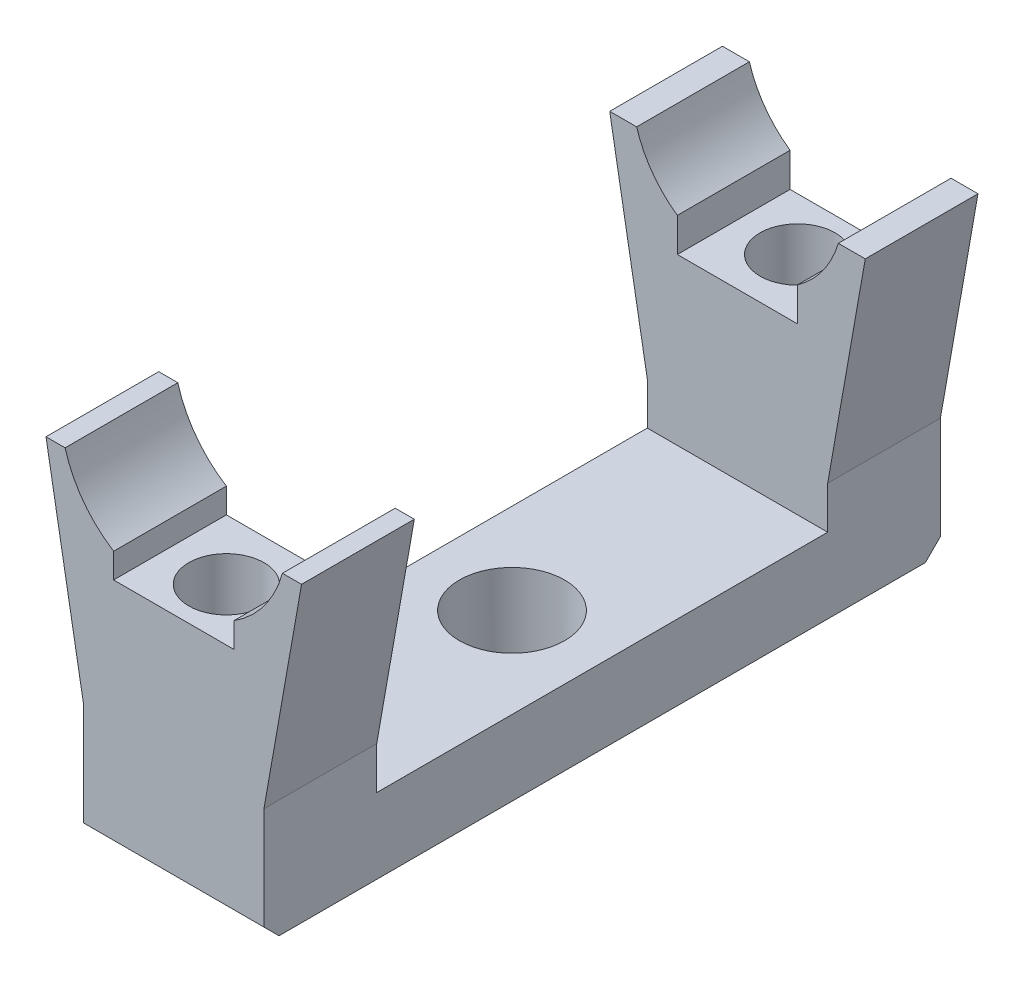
from build123d import *

# Parameters (mm, degrees)
EXTRUDE_1_DEPTH          = 22.5
SKETCH_2_R               = 7.5
CUT_EXTRUDE_1_DEPTH      = 7.5
CUT_EXTRUDE_2_DEPTH      = 31.903729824
CUT_EXTRUDE_2_DEPTH_BACK = 31.903729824
SKETCH_3_W               = 30
SKETCH_3_H               = 25.407314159
HOLE_WIZARD_M6_1_D       = 5
HOLE_WIZARD_M6_1_DEPTH   = 12
HOLE_WIZARD_M6_1_TIP     = 1.502151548
CUT_EXTRUDE_3_DEPTH      = 30.45335295
CUT_EXTRUDE_3_DEPTH_BACK = 30.45335295
SKETCH_8_R               = 3.5
CHAMFER_1_SIZE           = 1


with BuildPart() as part:
    # Sketch 1 → Extrude 1 (new, symmetric)
    with BuildSketch(Plane.XY):
        with BuildLine():
            Line((-6.708203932, 15.444756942), (-8.5, 15.444756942))
            Line((-8.5, 15.444756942), (-6, 1.266552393))
            Line((-6, 1.266552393), (-6, -6.555243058))
            Line((-6, -6.555243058), (6, -6.555243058))
            Line((6, -6.555243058), (6, 1.266552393))
            Line((6, 1.266552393), (8.5, 15.444756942))
            Line((8.5, 15.444756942), (6.708203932, 15.444756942))
            ThreePointArc((6.708203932, 15.444756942), (5.672023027, 13.342543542), (4, 11.700194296))
            Line((4, 11.700194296), (4, 9.444756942))
            Line((4, 9.444756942), (-4, 9.444756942))
            Line((-4, 9.444756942), (-4, 11.700194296))
            ThreePointArc((-4, 11.700194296), (-5.672023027, 13.342543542), (-6.708203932, 15.444756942))
        make_face()
    extrude(amount=EXTRUDE_1_DEPTH, both=True)

    # Sketch 2 → Cut-Extrude 1 (cut)
    with BuildSketch(Plane.XY.offset(22.5)):
        with Locations((0, 17.444756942)):
            Circle(SKETCH_2_R)
    extrude(amount=-CUT_EXTRUDE_1_DEPTH, mode=Mode.SUBTRACT)

    # Sketch 3 → Cut-Extrude 2 (cut, two sides: drawn at the far end of the back side and taken through both)
    with BuildSketch(Plane.ZY.offset(6).offset(-CUT_EXTRUDE_2_DEPTH_BACK)):
        with Locations((0, 11.148414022)):
            Rectangle(SKETCH_3_W, SKETCH_3_H)
    extrude(amount=CUT_EXTRUDE_2_DEPTH + CUT_EXTRUDE_2_DEPTH_BACK, mode=Mode.SUBTRACT)

    # Hole Wizard M6 _1
    with Locations(Plane(origin=(0, 9.444756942, 0), x_dir=(1, 0, 0), z_dir=(0, 1, 0))):
        with Locations((0, 19), (0, -19)):
            Hole(HOLE_WIZARD_M6_1_D / 2, depth=HOLE_WIZARD_M6_1_DEPTH)
            with Locations((0, 0, -(HOLE_WIZARD_M6_1_DEPTH + HOLE_WIZARD_M6_1_TIP / 2))):  # 118° drill point
                Cone(0, HOLE_WIZARD_M6_1_D / 2, HOLE_WIZARD_M6_1_TIP, mode=Mode.SUBTRACT)

    # Sketch 8 → Cut-Extrude 3 (cut, two sides: drawn at the far end of the back side and taken through both)
    with BuildSketch(Plane(origin=(0, -1.555243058, 0), x_dir=(1, 0, 0), z_dir=(0, 1, 0)).offset(-CUT_EXTRUDE_3_DEPTH_BACK)):
        with Locations(Location((0, 0, 0), (0, 0, 270))):
            Circle(SKETCH_8_R)
    extrude(amount=CUT_EXTRUDE_3_DEPTH + CUT_EXTRUDE_3_DEPTH_BACK, mode=Mode.SUBTRACT)

    # Chamfer 1
    chamfer_1_edges = [part.edges().sort_by_distance(p)[0] for p in [
        (0, -6.555243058, -22.5),
        (0, -6.555243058, 22.5),
    ]]
    chamfer(chamfer_1_edges, length=CHAMFER_1_SIZE)


solid = part.part
